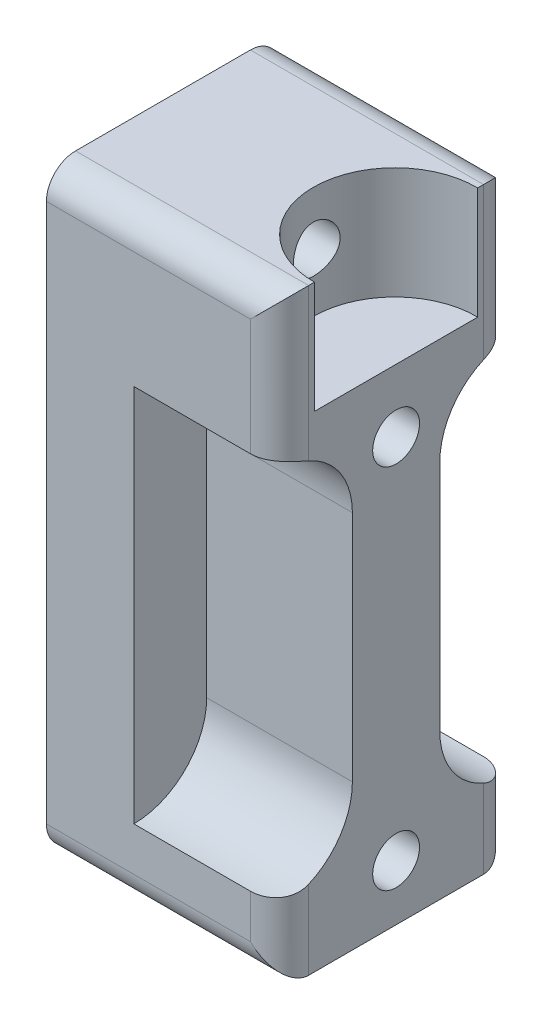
from build123d import *

# Parameters (mm, degrees)
SKETCH1_W               = 25.4
SKETCH1_H               = 25.4
BOSS_EXTRUDE1_DEPTH     = 65.0875
SKETCH2_R               = 8.89
CUT_EXTRUDE1_DEPTH      = 12.192
F_1_4_20_TAPPED_HOLE1_D = 5.1054
CUT_EXTRUDE2_DEPTH      = 15.875
FILLET1_R               = 3.175


with BuildPart() as part:
    # Sketch1 → Boss-Extrude1 (new body)
    with BuildSketch(Plane(origin=(0, 0, 0), x_dir=(1, 0, 0), z_dir=(0, 1, 0))):
        with Locations((-12.573, 0)):
            Rectangle(SKETCH1_W, SKETCH1_H)
    extrude(amount=-BOSS_EXTRUDE1_DEPTH)

    # Sketch2 → Cut-Extrude1 (cut)
    with BuildSketch(Plane(origin=(0, 0, 0), x_dir=(1, 0, 0), z_dir=(0, 1, 0))):
        Circle(SKETCH2_R)
    extrude(amount=-CUT_EXTRUDE1_DEPTH, mode=Mode.SUBTRACT)

    # 1_4-20 Tapped Hole1 (through all)
    with Locations(Plane.ZY.offset(25.273)):
        with Locations((0, -5.842), (0, -59.02325), (0, -19.05)):
            Hole(F_1_4_20_TAPPED_HOLE1_D / 2)

    # Sketch5 → Cut-Extrude2 (cut)
    with BuildSketch(Plane(origin=(0.127, 0, 0), x_dir=(0, 0, -1), z_dir=(1, 0, 0))):
        with BuildLine():
            Line((4.7625, -49.2125), (4.7625, -23.8125))
            ThreePointArc((4.7625, -23.8125), (12.7, -15.875), (20.6375, -23.8125))
            Line((20.6375, -23.8125), (20.6375, -49.2125))
            ThreePointArc((20.6375, -49.2125), (12.7, -57.15), (4.7625, -49.2125))
        make_face()
        with BuildLine():
            Line((-4.7625, -49.2125), (-4.7625, -23.8125))
            ThreePointArc((-4.7625, -23.8125), (-12.7, -15.875), (-20.6375, -23.8125))
            Line((-20.6375, -23.8125), (-20.6375, -49.2125))
            ThreePointArc((-20.6375, -49.2125), (-12.7, -57.15), (-4.7625, -49.2125))
        make_face()
    extrude(amount=-CUT_EXTRUDE2_DEPTH, mode=Mode.SUBTRACT)

    # Fillet1
    fillet1_edges = [part.edges().sort_by_distance(p)[0] for p in [
        (-12.573, -65.0875, -12.7),
        (0.127, -7.9375, -12.7),
        (-12.573, 0, -12.7),
        (-12.573, 0, 12.7),
        (0.127, -7.9375, 12.7),
        (-12.573, -65.0875, 12.7),
        (0.127, -61.11875, -12.7),
        (0.127, -61.11875, 12.7),
    ]]
    fillet(fillet1_edges, radius=FILLET1_R)


solid = part.part
